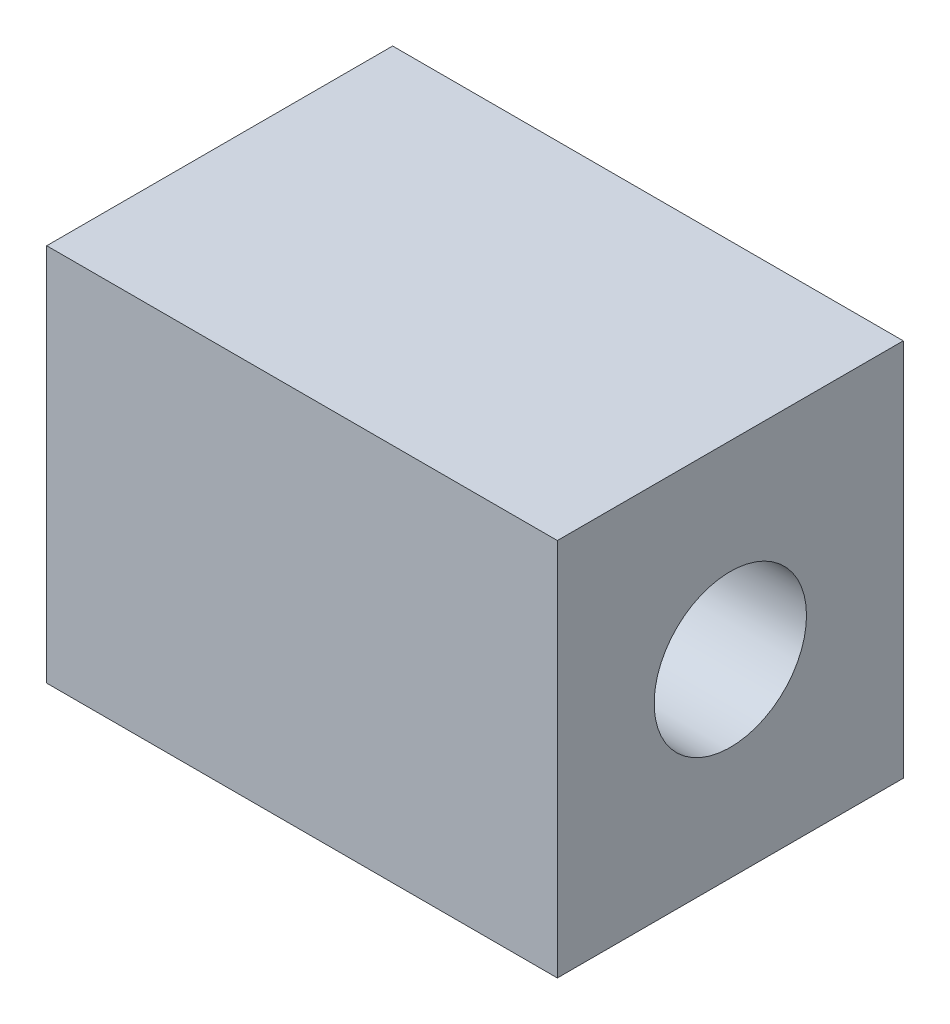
ISO-10303-21;
HEADER;
FILE_DESCRIPTION(('STEP AP214'),'2;1');
FILE_NAME('part.step','',(''),(''),'','','');
FILE_SCHEMA(('AUTOMOTIVE_DESIGN { 1 0 10303 214 1 1 1 1 }'));
ENDSEC;
DATA;
#1=APPLICATION_CONTEXT('core data for automotive mechanical design processes');
#2=APPLICATION_PROTOCOL_DEFINITION('international standard','automotive_design',2000,#1);
#3=PRODUCT_CONTEXT('',#1,'mechanical');
#4=PRODUCT('Part','Part','',(#3));
#5=PRODUCT_RELATED_PRODUCT_CATEGORY('part','',(#4));
#6=PRODUCT_DEFINITION_FORMATION('','',#4);
#7=PRODUCT_DEFINITION_CONTEXT('part definition',#1,'design');
#8=PRODUCT_DEFINITION('design','',#6,#7);
#9=PRODUCT_DEFINITION_SHAPE('','',#8);
#10=(LENGTH_UNIT() NAMED_UNIT(*) SI_UNIT(.MILLI.,.METRE.));
#11=(NAMED_UNIT(*) PLANE_ANGLE_UNIT() SI_UNIT($,.RADIAN.));
#12=(NAMED_UNIT(*) SI_UNIT($,.STERADIAN.) SOLID_ANGLE_UNIT());
#13=UNCERTAINTY_MEASURE_WITH_UNIT(LENGTH_MEASURE(1.E-05),#10,'distance_accuracy_value','');
#14=(GEOMETRIC_REPRESENTATION_CONTEXT(3) GLOBAL_UNCERTAINTY_ASSIGNED_CONTEXT((#13)) GLOBAL_UNIT_ASSIGNED_CONTEXT((#10,
#11,#12)) REPRESENTATION_CONTEXT('',''));
#15=CARTESIAN_POINT('',(0.,0.,0.));
#16=DIRECTION('',(0.,0.,1.));
#17=DIRECTION('',(1.,0.,0.));
#18=AXIS2_PLACEMENT_3D('',#15,#16,#17);
#19=CARTESIAN_POINT('',(0.,0.,42.));
#20=DIRECTION('',(1.,0.,0.));
#21=DIRECTION('',(0.,0.,-1.));
#22=AXIS2_PLACEMENT_3D('',#19,#20,#21);
#23=PLANE('',#22);
#24=CARTESIAN_POINT('',(0.,23.,21.));
#25=DIRECTION('',(1.,0.,0.));
#26=DIRECTION('',(0.,0.,-1.));
#27=AXIS2_PLACEMENT_3D('',#24,#25,#26);
#28=CIRCLE('',#27,9.24999999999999);
#29=CARTESIAN_POINT('',(0.,23.,11.75));
#30=VERTEX_POINT('',#29);
#31=EDGE_CURVE('E86',#30,#30,#28,.T.);
#32=ORIENTED_EDGE('',*,*,#31,.T.);
#33=EDGE_LOOP('',(#32));
#34=FACE_BOUND('',#33,.T.);
#35=DIRECTION('',(0.,-1.,0.));
#36=VECTOR('',#35,1.);
#37=CARTESIAN_POINT('',(0.,0.,0.));
#38=LINE('',#37,#36);
#39=CARTESIAN_POINT('',(0.,46.,0.));
#40=VERTEX_POINT('',#39);
#41=CARTESIAN_POINT('',(0.,0.,0.));
#42=VERTEX_POINT('',#41);
#43=EDGE_CURVE('E73',#40,#42,#38,.T.);
#44=ORIENTED_EDGE('',*,*,#43,.T.);
#45=DIRECTION('',(0.,0.,-1.));
#46=VECTOR('',#45,1.);
#47=CARTESIAN_POINT('',(0.,0.,42.));
#48=LINE('',#47,#46);
#49=CARTESIAN_POINT('',(0.,0.,42.));
#50=VERTEX_POINT('',#49);
#51=EDGE_CURVE('E11',#50,#42,#48,.T.);
#52=ORIENTED_EDGE('',*,*,#51,.F.);
#53=DIRECTION('',(0.,-1.,0.));
#54=VECTOR('',#53,1.);
#55=CARTESIAN_POINT('',(0.,0.,42.));
#56=LINE('',#55,#54);
#57=CARTESIAN_POINT('',(0.,46.,42.));
#58=VERTEX_POINT('',#57);
#59=EDGE_CURVE('E96',#58,#50,#56,.T.);
#60=ORIENTED_EDGE('',*,*,#59,.F.);
#61=DIRECTION('',(0.,0.,-1.));
#62=VECTOR('',#61,1.);
#63=CARTESIAN_POINT('',(0.,46.,42.));
#64=LINE('',#63,#62);
#65=EDGE_CURVE('E85',#58,#40,#64,.T.);
#66=ORIENTED_EDGE('',*,*,#65,.T.);
#67=EDGE_LOOP('',(#44,#52,#60,#66));
#68=FACE_BOUND('',#67,.T.);
#69=ADVANCED_FACE('F29',(#34,#68),#23,.F.);
#70=CARTESIAN_POINT('',(0.,0.,42.));
#71=DIRECTION('',(0.,1.,0.));
#72=DIRECTION('',(0.,0.,1.));
#73=AXIS2_PLACEMENT_3D('',#70,#71,#72);
#74=PLANE('',#73);
#75=DIRECTION('',(1.,0.,0.));
#76=VECTOR('',#75,1.);
#77=CARTESIAN_POINT('',(0.,0.,0.));
#78=LINE('',#77,#76);
#79=CARTESIAN_POINT('',(62.,0.,0.));
#80=VERTEX_POINT('',#79);
#81=EDGE_CURVE('E69',#42,#80,#78,.T.);
#82=ORIENTED_EDGE('',*,*,#81,.T.);
#83=DIRECTION('',(0.,0.,-1.));
#84=VECTOR('',#83,1.);
#85=CARTESIAN_POINT('',(62.,0.,42.));
#86=LINE('',#85,#84);
#87=CARTESIAN_POINT('',(62.,0.,42.));
#88=VERTEX_POINT('',#87);
#89=EDGE_CURVE('E36',#88,#80,#86,.T.);
#90=ORIENTED_EDGE('',*,*,#89,.F.);
#91=DIRECTION('',(1.,0.,0.));
#92=VECTOR('',#91,1.);
#93=CARTESIAN_POINT('',(0.,0.,42.));
#94=LINE('',#93,#92);
#95=EDGE_CURVE('E81',#50,#88,#94,.T.);
#96=ORIENTED_EDGE('',*,*,#95,.F.);
#97=ORIENTED_EDGE('',*,*,#51,.T.);
#98=EDGE_LOOP('',(#82,#90,#96,#97));
#99=FACE_BOUND('',#98,.T.);
#100=ADVANCED_FACE('F80',(#99),#74,.F.);
#101=CARTESIAN_POINT('',(62.,0.,42.));
#102=DIRECTION('',(-1.,0.,0.));
#103=DIRECTION('',(0.,0.,1.));
#104=AXIS2_PLACEMENT_3D('',#101,#102,#103);
#105=PLANE('',#104);
#106=CARTESIAN_POINT('',(62.,23.,21.));
#107=DIRECTION('',(1.,0.,0.));
#108=DIRECTION('',(0.,0.,-1.));
#109=AXIS2_PLACEMENT_3D('',#106,#107,#108);
#110=CIRCLE('',#109,9.24999999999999);
#111=CARTESIAN_POINT('',(62.,23.,11.75));
#112=VERTEX_POINT('',#111);
#113=EDGE_CURVE('E89',#112,#112,#110,.T.);
#114=ORIENTED_EDGE('',*,*,#113,.F.);
#115=EDGE_LOOP('',(#114));
#116=FACE_BOUND('',#115,.T.);
#117=DIRECTION('',(0.,1.,0.));
#118=VECTOR('',#117,1.);
#119=CARTESIAN_POINT('',(62.,0.,0.));
#120=LINE('',#119,#118);
#121=CARTESIAN_POINT('',(62.,46.,0.));
#122=VERTEX_POINT('',#121);
#123=EDGE_CURVE('E74',#80,#122,#120,.T.);
#124=ORIENTED_EDGE('',*,*,#123,.T.);
#125=DIRECTION('',(0.,0.,-1.));
#126=VECTOR('',#125,1.);
#127=CARTESIAN_POINT('',(62.,46.,42.));
#128=LINE('',#127,#126);
#129=CARTESIAN_POINT('',(62.,46.,42.));
#130=VERTEX_POINT('',#129);
#131=EDGE_CURVE('E102',#130,#122,#128,.T.);
#132=ORIENTED_EDGE('',*,*,#131,.F.);
#133=DIRECTION('',(0.,1.,0.));
#134=VECTOR('',#133,1.);
#135=CARTESIAN_POINT('',(62.,0.,42.));
#136=LINE('',#135,#134);
#137=EDGE_CURVE('E48',#88,#130,#136,.T.);
#138=ORIENTED_EDGE('',*,*,#137,.F.);
#139=ORIENTED_EDGE('',*,*,#89,.T.);
#140=EDGE_LOOP('',(#124,#132,#138,#139));
#141=FACE_BOUND('',#140,.T.);
#142=ADVANCED_FACE('F105',(#116,#141),#105,.F.);
#143=CARTESIAN_POINT('',(0.,46.,42.));
#144=DIRECTION('',(0.,-1.,0.));
#145=DIRECTION('',(0.,0.,-1.));
#146=AXIS2_PLACEMENT_3D('',#143,#144,#145);
#147=PLANE('',#146);
#148=DIRECTION('',(-1.,0.,0.));
#149=VECTOR('',#148,1.);
#150=CARTESIAN_POINT('',(0.,46.,0.));
#151=LINE('',#150,#149);
#152=EDGE_CURVE('E94',#122,#40,#151,.T.);
#153=ORIENTED_EDGE('',*,*,#152,.T.);
#154=ORIENTED_EDGE('',*,*,#65,.F.);
#155=DIRECTION('',(-1.,0.,0.));
#156=VECTOR('',#155,1.);
#157=CARTESIAN_POINT('',(0.,46.,42.));
#158=LINE('',#157,#156);
#159=EDGE_CURVE('E43',#130,#58,#158,.T.);
#160=ORIENTED_EDGE('',*,*,#159,.F.);
#161=ORIENTED_EDGE('',*,*,#131,.T.);
#162=EDGE_LOOP('',(#153,#154,#160,#161));
#163=FACE_BOUND('',#162,.T.);
#164=ADVANCED_FACE('F107',(#163),#147,.F.);
#165=CARTESIAN_POINT('',(0.,46.,42.));
#166=DIRECTION('',(0.,0.,-1.));
#167=DIRECTION('',(-1.,0.,0.));
#168=AXIS2_PLACEMENT_3D('',#165,#166,#167);
#169=PLANE('',#168);
#170=ORIENTED_EDGE('',*,*,#59,.T.);
#171=ORIENTED_EDGE('',*,*,#95,.T.);
#172=ORIENTED_EDGE('',*,*,#137,.T.);
#173=ORIENTED_EDGE('',*,*,#159,.T.);
#174=EDGE_LOOP('',(#170,#171,#172,#173));
#175=FACE_BOUND('',#174,.T.);
#176=ADVANCED_FACE('F108',(#175),#169,.F.);
#177=CARTESIAN_POINT('',(0.,46.,0.));
#178=DIRECTION('',(0.,0.,-1.));
#179=DIRECTION('',(-1.,0.,0.));
#180=AXIS2_PLACEMENT_3D('',#177,#178,#179);
#181=PLANE('',#180);
#182=ORIENTED_EDGE('',*,*,#43,.F.);
#183=ORIENTED_EDGE('',*,*,#152,.F.);
#184=ORIENTED_EDGE('',*,*,#123,.F.);
#185=ORIENTED_EDGE('',*,*,#81,.F.);
#186=EDGE_LOOP('',(#182,#183,#184,#185));
#187=FACE_BOUND('',#186,.T.);
#188=ADVANCED_FACE('F70',(#187),#181,.T.);
#189=CARTESIAN_POINT('',(62.,23.,21.));
#190=DIRECTION('',(1.,0.,0.));
#191=DIRECTION('',(0.,0.,-1.));
#192=AXIS2_PLACEMENT_3D('',#189,#190,#191);
#193=CYLINDRICAL_SURFACE('',#192,9.24999999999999);
#194=ORIENTED_EDGE('',*,*,#113,.T.);
#195=EDGE_LOOP('',(#194));
#196=FACE_BOUND('',#195,.T.);
#197=ORIENTED_EDGE('',*,*,#31,.F.);
#198=EDGE_LOOP('',(#197));
#199=FACE_BOUND('',#198,.T.);
#200=ADVANCED_FACE('F115',(#196,#199),#193,.F.);
#201=CLOSED_SHELL('',(#69,#100,#142,#164,#176,#188,#200));
#202=MANIFOLD_SOLID_BREP('B2',#201);
#203=ADVANCED_BREP_SHAPE_REPRESENTATION('',(#18,#202),#14);
#204=SHAPE_DEFINITION_REPRESENTATION(#9,#203);
ENDSEC;
END-ISO-10303-21;
